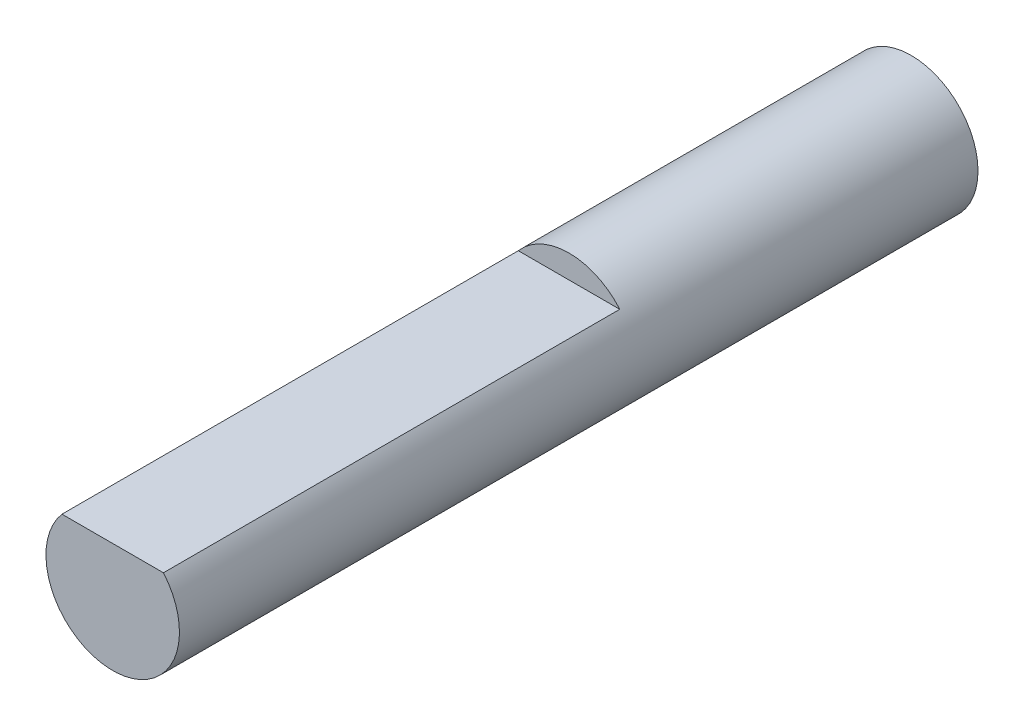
from build123d import *

# Parameters (mm, degrees)
SKETCH1_R           = 1.4859
BOSS_EXTRUDE1_DEPTH = 17.78
SKETCH2_W           = 3.5673449
SKETCH2_H           = 0.889495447
CUT_EXTRUDE1_DEPTH  = 10.16


with BuildPart() as part:
    # Sketch1 → Boss-Extrude1 (new body)
    with BuildSketch(Plane.XY):
        Circle(SKETCH1_R)
    extrude(amount=BOSS_EXTRUDE1_DEPTH)

    # Sketch2 → Cut-Extrude1 (cut)
    with BuildSketch(Plane.XY.offset(17.78)):
        with Locations((0.219940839, 1.409947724)):
            Rectangle(SKETCH2_W, SKETCH2_H)
    extrude(amount=-CUT_EXTRUDE1_DEPTH, mode=Mode.SUBTRACT)


solid = part.part
